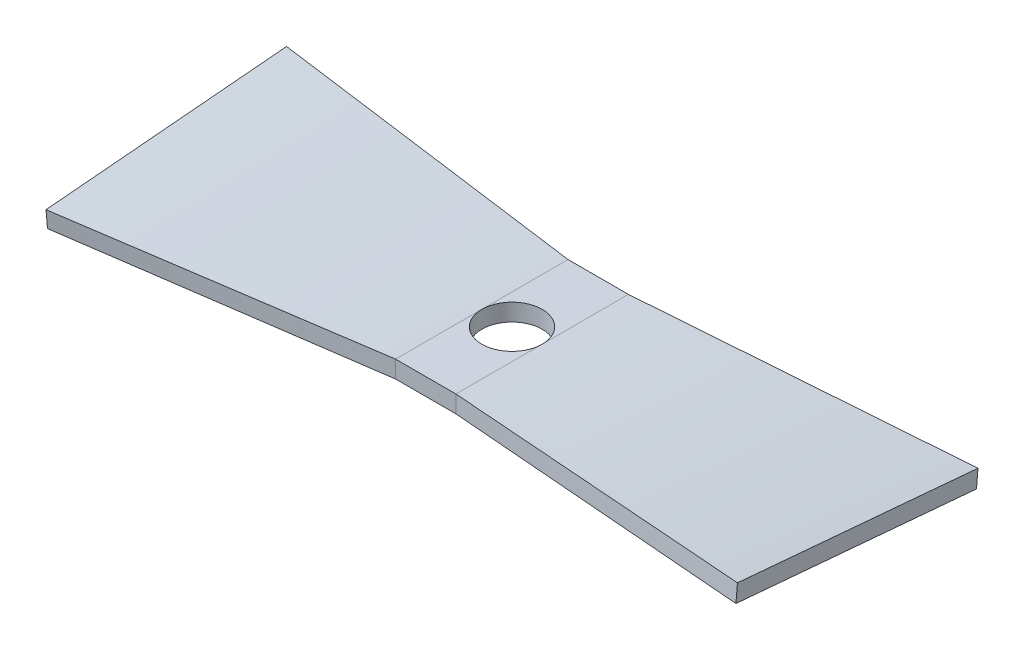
ISO-10303-21;
HEADER;
FILE_DESCRIPTION(('STEP AP214'),'2;1');
FILE_NAME('part.step','',(''),(''),'','','');
FILE_SCHEMA(('AUTOMOTIVE_DESIGN { 1 0 10303 214 1 1 1 1 }'));
ENDSEC;
DATA;
#1=APPLICATION_CONTEXT('core data for automotive mechanical design processes');
#2=APPLICATION_PROTOCOL_DEFINITION('international standard','automotive_design',2000,#1);
#3=PRODUCT_CONTEXT('',#1,'mechanical');
#4=PRODUCT('Part','Part','',(#3));
#5=PRODUCT_RELATED_PRODUCT_CATEGORY('part','',(#4));
#6=PRODUCT_DEFINITION_FORMATION('','',#4);
#7=PRODUCT_DEFINITION_CONTEXT('part definition',#1,'design');
#8=PRODUCT_DEFINITION('design','',#6,#7);
#9=PRODUCT_DEFINITION_SHAPE('','',#8);
#10=(LENGTH_UNIT() NAMED_UNIT(*) SI_UNIT(.MILLI.,.METRE.));
#11=(NAMED_UNIT(*) PLANE_ANGLE_UNIT() SI_UNIT($,.RADIAN.));
#12=(NAMED_UNIT(*) SI_UNIT($,.STERADIAN.) SOLID_ANGLE_UNIT());
#13=UNCERTAINTY_MEASURE_WITH_UNIT(LENGTH_MEASURE(1.E-05),#10,'distance_accuracy_value','');
#14=(GEOMETRIC_REPRESENTATION_CONTEXT(3) GLOBAL_UNCERTAINTY_ASSIGNED_CONTEXT((#13)) GLOBAL_UNIT_ASSIGNED_CONTEXT((#10,
#11,#12)) REPRESENTATION_CONTEXT('',''));
#15=CARTESIAN_POINT('',(0.,0.,0.));
#16=DIRECTION('',(0.,0.,1.));
#17=DIRECTION('',(1.,0.,0.));
#18=AXIS2_PLACEMENT_3D('',#15,#16,#17);
#19=CARTESIAN_POINT('',(-44.1414213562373,0.5,0.));
#20=DIRECTION('',(0.,1.,0.));
#21=DIRECTION('',(0.,0.,1.));
#22=AXIS2_PLACEMENT_3D('',#19,#20,#21);
#23=PLANE('',#22);
#24=CARTESIAN_POINT('',(0.,0.5,0.));
#25=DIRECTION('',(0.,1.,0.));
#26=DIRECTION('',(0.,0.,1.));
#27=AXIS2_PLACEMENT_3D('',#24,#25,#26);
#28=CIRCLE('',#27,1.75);
#29=CARTESIAN_POINT('',(1.75,0.5,0.));
#30=VERTEX_POINT('',#29);
#31=CARTESIAN_POINT('',(-1.75,0.5,0.));
#32=VERTEX_POINT('',#31);
#33=EDGE_CURVE('E68',#30,#32,#28,.T.);
#34=ORIENTED_EDGE('',*,*,#33,.F.);
#35=DIRECTION('',(0.,0.,1.));
#36=VECTOR('',#35,1.);
#37=CARTESIAN_POINT('',(1.75,0.5,0.));
#38=LINE('',#37,#36);
#39=CARTESIAN_POINT('',(1.75000000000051,0.499999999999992,-5.00000000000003));
#40=VERTEX_POINT('',#39);
#41=EDGE_CURVE('E131',#40,#30,#38,.T.);
#42=ORIENTED_EDGE('',*,*,#41,.F.);
#43=DIRECTION('',(1.,0.,0.));
#44=VECTOR('',#43,1.);
#45=CARTESIAN_POINT('',(-44.1414213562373,0.5,-5.));
#46=LINE('',#45,#44);
#47=CARTESIAN_POINT('',(-1.75000000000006,0.500000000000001,-5.));
#48=VERTEX_POINT('',#47);
#49=EDGE_CURVE('E149',#48,#40,#46,.T.);
#50=ORIENTED_EDGE('',*,*,#49,.F.);
#51=DIRECTION('',(0.,0.,1.));
#52=VECTOR('',#51,1.);
#53=CARTESIAN_POINT('',(-1.75,0.5,0.));
#54=LINE('',#53,#52);
#55=EDGE_CURVE('E134',#48,#32,#54,.T.);
#56=ORIENTED_EDGE('',*,*,#55,.T.);
#57=EDGE_LOOP('',(#34,#42,#50,#56));
#58=FACE_BOUND('',#57,.T.);
#59=ADVANCED_FACE('F46',(#58),#23,.T.);
#60=CARTESIAN_POINT('',(-44.1414213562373,-0.5,0.));
#61=DIRECTION('',(0.,1.,0.));
#62=DIRECTION('',(0.,0.,1.));
#63=AXIS2_PLACEMENT_3D('',#60,#61,#62);
#64=PLANE('',#63);
#65=DIRECTION('',(0.,0.,1.));
#66=VECTOR('',#65,1.);
#67=CARTESIAN_POINT('',(1.75,-0.5,0.));
#68=LINE('',#67,#66);
#69=CARTESIAN_POINT('',(1.75000000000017,-0.500000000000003,-5.00000000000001));
#70=VERTEX_POINT('',#69);
#71=CARTESIAN_POINT('',(1.75,-0.5,0.));
#72=VERTEX_POINT('',#71);
#73=EDGE_CURVE('E157',#70,#72,#68,.T.);
#74=ORIENTED_EDGE('',*,*,#73,.T.);
#75=CARTESIAN_POINT('',(0.,-0.5,0.));
#76=DIRECTION('',(0.,1.,0.));
#77=DIRECTION('',(0.,0.,1.));
#78=AXIS2_PLACEMENT_3D('',#75,#76,#77);
#79=CIRCLE('',#78,1.75);
#80=CARTESIAN_POINT('',(-1.75,-0.5,0.));
#81=VERTEX_POINT('',#80);
#82=EDGE_CURVE('E61',#72,#81,#79,.T.);
#83=ORIENTED_EDGE('',*,*,#82,.T.);
#84=DIRECTION('',(0.,0.,1.));
#85=VECTOR('',#84,1.);
#86=CARTESIAN_POINT('',(-1.75,-0.5,0.));
#87=LINE('',#86,#85);
#88=CARTESIAN_POINT('',(-1.75000000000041,-0.499999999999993,-5.00000000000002));
#89=VERTEX_POINT('',#88);
#90=EDGE_CURVE('E50',#89,#81,#87,.T.);
#91=ORIENTED_EDGE('',*,*,#90,.F.);
#92=DIRECTION('',(1.,0.,0.));
#93=VECTOR('',#92,1.);
#94=CARTESIAN_POINT('',(-44.1414213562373,-0.5,-5.));
#95=LINE('',#94,#93);
#96=EDGE_CURVE('E160',#89,#70,#95,.T.);
#97=ORIENTED_EDGE('',*,*,#96,.T.);
#98=EDGE_LOOP('',(#74,#83,#91,#97));
#99=FACE_BOUND('',#98,.T.);
#100=ADVANCED_FACE('F453',(#99),#64,.F.);
#101=CARTESIAN_POINT('',(-44.1414213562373,0.5,4.99999999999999));
#102=DIRECTION('',(0.,0.,-1.));
#103=DIRECTION('',(-1.,0.,0.));
#104=AXIS2_PLACEMENT_3D('',#101,#102,#103);
#105=PLANE('',#104);
#106=DIRECTION('',(1.,0.,0.));
#107=VECTOR('',#106,1.);
#108=CARTESIAN_POINT('',(-44.1414213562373,-0.5,4.99999999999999));
#109=LINE('',#108,#107);
#110=CARTESIAN_POINT('',(-1.75000000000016,-0.500000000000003,5.));
#111=VERTEX_POINT('',#110);
#112=CARTESIAN_POINT('',(1.74999999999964,-0.500000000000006,4.99999999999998));
#113=VERTEX_POINT('',#112);
#114=EDGE_CURVE('E166',#111,#113,#109,.T.);
#115=ORIENTED_EDGE('',*,*,#114,.T.);
#116=DIRECTION('',(0.,1.,0.));
#117=VECTOR('',#116,1.);
#118=CARTESIAN_POINT('',(1.75,0.5,4.99999999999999));
#119=LINE('',#118,#117);
#120=CARTESIAN_POINT('',(1.75000000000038,0.500000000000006,5.00000000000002));
#121=VERTEX_POINT('',#120);
#122=EDGE_CURVE('E55',#121,#113,#119,.F.);
#123=ORIENTED_EDGE('',*,*,#122,.F.);
#124=DIRECTION('',(1.,0.,0.));
#125=VECTOR('',#124,1.);
#126=CARTESIAN_POINT('',(-44.1414213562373,0.5,4.99999999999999));
#127=LINE('',#126,#125);
#128=CARTESIAN_POINT('',(-1.75000000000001,0.5,5.));
#129=VERTEX_POINT('',#128);
#130=EDGE_CURVE('E140',#129,#121,#127,.T.);
#131=ORIENTED_EDGE('',*,*,#130,.F.);
#132=DIRECTION('',(0.,1.,0.));
#133=VECTOR('',#132,1.);
#134=CARTESIAN_POINT('',(-1.75,0.5,4.99999999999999));
#135=LINE('',#134,#133);
#136=EDGE_CURVE('E12',#129,#111,#135,.F.);
#137=ORIENTED_EDGE('',*,*,#136,.T.);
#138=EDGE_LOOP('',(#115,#123,#131,#137));
#139=FACE_BOUND('',#138,.T.);
#140=ADVANCED_FACE('F48',(#139),#105,.F.);
#141=CARTESIAN_POINT('',(-44.1414213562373,0.5,-5.));
#142=DIRECTION('',(0.,0.,-1.));
#143=DIRECTION('',(-1.,0.,0.));
#144=AXIS2_PLACEMENT_3D('',#141,#142,#143);
#145=PLANE('',#144);
#146=ORIENTED_EDGE('',*,*,#96,.F.);
#147=DIRECTION('',(0.,1.,0.));
#148=VECTOR('',#147,1.);
#149=CARTESIAN_POINT('',(-1.75,0.5,-5.));
#150=LINE('',#149,#148);
#151=EDGE_CURVE('E150',#48,#89,#150,.F.);
#152=ORIENTED_EDGE('',*,*,#151,.F.);
#153=ORIENTED_EDGE('',*,*,#49,.T.);
#154=DIRECTION('',(0.,1.,0.));
#155=VECTOR('',#154,1.);
#156=CARTESIAN_POINT('',(1.75,0.5,-5.));
#157=LINE('',#156,#155);
#158=EDGE_CURVE('E155',#40,#70,#157,.F.);
#159=ORIENTED_EDGE('',*,*,#158,.T.);
#160=EDGE_LOOP('',(#146,#152,#153,#159));
#161=FACE_BOUND('',#160,.T.);
#162=ADVANCED_FACE('F450',(#161),#145,.T.);
#163=EDGE_CURVE('E121',#32,#30,#28,.T.);
#164=ORIENTED_EDGE('',*,*,#163,.F.);
#165=EDGE_CURVE('E163',#32,#129,#54,.T.);
#166=ORIENTED_EDGE('',*,*,#165,.T.);
#167=ORIENTED_EDGE('',*,*,#130,.T.);
#168=EDGE_CURVE('E137',#30,#121,#38,.T.);
#169=ORIENTED_EDGE('',*,*,#168,.F.);
#170=EDGE_LOOP('',(#164,#166,#167,#169));
#171=FACE_BOUND('',#170,.T.);
#172=ADVANCED_FACE('F138',(#171),#23,.T.);
#173=EDGE_CURVE('E404',#81,#111,#87,.T.);
#174=ORIENTED_EDGE('',*,*,#173,.F.);
#175=EDGE_CURVE('E135',#81,#72,#79,.T.);
#176=ORIENTED_EDGE('',*,*,#175,.T.);
#177=EDGE_CURVE('E161',#72,#113,#68,.T.);
#178=ORIENTED_EDGE('',*,*,#177,.T.);
#179=ORIENTED_EDGE('',*,*,#114,.F.);
#180=EDGE_LOOP('',(#174,#176,#178,#179));
#181=FACE_BOUND('',#180,.T.);
#182=ADVANCED_FACE('F367',(#181),#64,.F.);
#183=CARTESIAN_POINT('',(20.,-1.10818754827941,-6.92978501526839));
#184=DIRECTION('',(-1.,0.,0.));
#185=DIRECTION('',(0.,-1.,0.));
#186=AXIS2_PLACEMENT_3D('',#183,#184,#185);
#187=PLANE('',#186);
#188=DIRECTION('',(0.,-0.996194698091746,0.0871557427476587));
#189=VECTOR('',#188,1.);
#190=CARTESIAN_POINT('',(20.,-0.111992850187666,-7.01694075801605));
#191=LINE('',#190,#189);
#192=CARTESIAN_POINT('',(20.,-0.111992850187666,-7.01694075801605));
#193=VERTEX_POINT('',#192);
#194=CARTESIAN_POINT('',(20.,-1.10818754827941,-6.92978501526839));
#195=VERTEX_POINT('',#194);
#196=EDGE_CURVE('E398',#193,#195,#191,.T.);
#197=ORIENTED_EDGE('',*,*,#196,.F.);
#198=DIRECTION('',(0.,-0.0871557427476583,-0.996194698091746));
#199=VECTOR('',#198,1.);
#200=CARTESIAN_POINT('',(20.,-0.111992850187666,-7.01694075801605));
#201=LINE('',#200,#199);
#202=CARTESIAN_POINT('',(20.,1.10818754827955,6.92978501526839));
#203=VERTEX_POINT('',#202);
#204=EDGE_CURVE('E335',#203,#193,#201,.T.);
#205=ORIENTED_EDGE('',*,*,#204,.F.);
#206=DIRECTION('',(0.,0.996194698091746,-0.0871557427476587));
#207=VECTOR('',#206,1.);
#208=CARTESIAN_POINT('',(20.,1.10818754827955,6.92978501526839));
#209=LINE('',#208,#207);
#210=CARTESIAN_POINT('',(20.,0.111992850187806,7.01694075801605));
#211=VERTEX_POINT('',#210);
#212=EDGE_CURVE('E397',#211,#203,#209,.T.);
#213=ORIENTED_EDGE('',*,*,#212,.F.);
#214=DIRECTION('',(0.,0.0871557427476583,0.996194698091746));
#215=VECTOR('',#214,1.);
#216=CARTESIAN_POINT('',(20.,-1.10818754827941,-6.92978501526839));
#217=LINE('',#216,#215);
#218=EDGE_CURVE('E389',#195,#211,#217,.T.);
#219=ORIENTED_EDGE('',*,*,#218,.F.);
#220=EDGE_LOOP('',(#197,#205,#213,#219));
#221=FACE_BOUND('',#220,.T.);
#222=ADVANCED_FACE('F355',(#221),#187,.F.);
#223=CARTESIAN_POINT('',(20.,1.10818754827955,6.9297850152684));
#224=CARTESIAN_POINT('',(1.75,0.5,4.99999999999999));
#225=CARTESIAN_POINT('',(20.,0.904824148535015,4.60533071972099));
#226=CARTESIAN_POINT('',(1.75,0.5,3.33333333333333));
#227=CARTESIAN_POINT('',(20.,0.701460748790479,2.28087642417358));
#228=CARTESIAN_POINT('',(1.75,0.5,1.66666666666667));
#229=CARTESIAN_POINT('',(20.,0.294733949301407,-2.36803216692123));
#230=CARTESIAN_POINT('',(1.75,0.5,-1.66666666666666));
#231=CARTESIAN_POINT('',(20.,0.0913705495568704,-4.69248646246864));
#232=CARTESIAN_POINT('',(1.75,0.5,-3.33333333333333));
#233=CARTESIAN_POINT('',(20.,-0.111992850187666,-7.01694075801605));
#234=CARTESIAN_POINT('',(1.75,0.5,-5.));
#235=B_SPLINE_SURFACE_WITH_KNOTS('',3,1,((#223,#224),(#225,#226),(#227,#228),(#229,#230),(#231,
#232),(#233,#234)),.UNSPECIFIED.,.F.,.F.,.F.,(4,2,4),(2,2),(0.,0.5,1.),(0.,1.),.UNSPECIFIED.);
#236=DIRECTION('',(-0.993396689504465,0.0333124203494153,0.109787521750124));
#237=VECTOR('',#236,1.);
#238=CARTESIAN_POINT('',(10.875,0.194003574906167,-6.00847037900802));
#239=LINE('',#238,#237);
#240=EDGE_CURVE('E148',#193,#40,#239,.T.);
#241=DIRECTION('',(0.993910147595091,0.0331223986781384,0.105097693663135));
#242=VECTOR('',#241,1.);
#243=CARTESIAN_POINT('',(10.875,0.804093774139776,5.9648925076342));
#244=LINE('',#243,#242);
#245=EDGE_CURVE('E341',#121,#203,#244,.T.);
#246=ORIENTED_EDGE('',*,*,#204,.T.);
#247=ORIENTED_EDGE('',*,*,#240,.T.);
#248=ORIENTED_EDGE('',*,*,#41,.T.);
#249=ORIENTED_EDGE('',*,*,#168,.T.);
#250=ORIENTED_EDGE('',*,*,#245,.T.);
#251=EDGE_LOOP('',(#246,#247,#248,#249,#250));
#252=FACE_BOUND('',#251,.T.);
#253=ADVANCED_FACE('F147',(#252),#235,.T.);
#254=CARTESIAN_POINT('',(20.,-0.111992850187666,-7.01694075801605));
#255=CARTESIAN_POINT('',(1.75,0.5,-5.));
#256=CARTESIAN_POINT('',(20.,-0.278025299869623,-7.00241480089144));
#257=CARTESIAN_POINT('',(1.75,0.333333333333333,-5.));
#258=CARTESIAN_POINT('',(20.,-0.444057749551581,-6.98788884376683));
#259=CARTESIAN_POINT('',(1.75,0.166666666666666,-5.));
#260=CARTESIAN_POINT('',(20.,-0.776122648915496,-6.95883692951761));
#261=CARTESIAN_POINT('',(1.75,-0.166666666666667,-5.));
#262=CARTESIAN_POINT('',(20.,-0.942155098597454,-6.944310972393));
#263=CARTESIAN_POINT('',(1.75,-0.333333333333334,-5.));
#264=CARTESIAN_POINT('',(20.,-1.10818754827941,-6.92978501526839));
#265=CARTESIAN_POINT('',(1.75,-0.5,-5.));
#266=B_SPLINE_SURFACE_WITH_KNOTS('',3,1,((#254,#255),(#256,#257),(#258,#259),(#260,#261),(#262,
#263),(#264,#265)),.UNSPECIFIED.,.F.,.F.,.F.,(4,2,4),(2,2),(0.,0.5,1.),(0.,1.),.UNSPECIFIED.);
#267=DIRECTION('',(-0.993910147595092,0.0331223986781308,0.105097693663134));
#268=VECTOR('',#267,1.);
#269=CARTESIAN_POINT('',(10.875,-0.804093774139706,-5.96489250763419));
#270=LINE('',#269,#268);
#271=EDGE_CURVE('E419',#195,#70,#270,.T.);
#272=ORIENTED_EDGE('',*,*,#196,.T.);
#273=ORIENTED_EDGE('',*,*,#271,.T.);
#274=ORIENTED_EDGE('',*,*,#158,.F.);
#275=ORIENTED_EDGE('',*,*,#240,.F.);
#276=EDGE_LOOP('',(#272,#273,#274,#275));
#277=FACE_BOUND('',#276,.T.);
#278=ADVANCED_FACE('F354',(#277),#266,.T.);
#279=CARTESIAN_POINT('',(20.,0.111992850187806,7.01694075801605));
#280=CARTESIAN_POINT('',(1.75,-0.5,4.99999999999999));
#281=CARTESIAN_POINT('',(20.,0.278025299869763,7.00241480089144));
#282=CARTESIAN_POINT('',(1.75,-0.333333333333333,4.99999999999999));
#283=CARTESIAN_POINT('',(20.,0.444057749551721,6.98788884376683));
#284=CARTESIAN_POINT('',(1.75,-0.166666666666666,4.99999999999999));
#285=CARTESIAN_POINT('',(20.,0.776122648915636,6.95883692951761));
#286=CARTESIAN_POINT('',(1.75,0.166666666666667,4.99999999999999));
#287=CARTESIAN_POINT('',(20.,0.942155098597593,6.944310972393));
#288=CARTESIAN_POINT('',(1.75,0.333333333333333,4.99999999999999));
#289=CARTESIAN_POINT('',(20.,1.10818754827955,6.92978501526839));
#290=CARTESIAN_POINT('',(1.75,0.5,4.99999999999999));
#291=B_SPLINE_SURFACE_WITH_KNOTS('',3,1,((#279,#280),(#281,#282),(#283,#284),(#285,#286),(#287,
#288),(#289,#290)),.UNSPECIFIED.,.F.,.F.,.F.,(4,2,4),(2,2),(0.,0.5,1.),(0.,1.),.UNSPECIFIED.);
#292=DIRECTION('',(-0.993396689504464,-0.0333124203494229,-0.109787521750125));
#293=VECTOR('',#292,1.);
#294=CARTESIAN_POINT('',(10.875,-0.194003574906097,6.00847037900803));
#295=LINE('',#294,#293);
#296=EDGE_CURVE('E283',#211,#113,#295,.T.);
#297=ORIENTED_EDGE('',*,*,#212,.T.);
#298=ORIENTED_EDGE('',*,*,#245,.F.);
#299=ORIENTED_EDGE('',*,*,#122,.T.);
#300=ORIENTED_EDGE('',*,*,#296,.F.);
#301=EDGE_LOOP('',(#297,#298,#299,#300));
#302=FACE_BOUND('',#301,.T.);
#303=ADVANCED_FACE('F416',(#302),#291,.T.);
#304=CARTESIAN_POINT('',(20.,-1.10818754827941,-6.92978501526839));
#305=CARTESIAN_POINT('',(1.75,-0.5,-5.));
#306=CARTESIAN_POINT('',(20.,-0.904824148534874,-4.60533071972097));
#307=CARTESIAN_POINT('',(1.75,-0.5,-3.33333333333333));
#308=CARTESIAN_POINT('',(20.,-0.701460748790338,-2.28087642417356));
#309=CARTESIAN_POINT('',(1.75,-0.5,-1.66666666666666));
#310=CARTESIAN_POINT('',(20.,-0.294733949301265,2.36803216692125));
#311=CARTESIAN_POINT('',(1.75,-0.5,1.66666666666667));
#312=CARTESIAN_POINT('',(20.,-0.0913705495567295,4.69248646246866));
#313=CARTESIAN_POINT('',(1.75,-0.5,3.33333333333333));
#314=CARTESIAN_POINT('',(20.,0.111992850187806,7.01694075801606));
#315=CARTESIAN_POINT('',(1.75,-0.5,4.99999999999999));
#316=B_SPLINE_SURFACE_WITH_KNOTS('',3,1,((#304,#305),(#306,#307),(#308,#309),(#310,#311),(#312,
#313),(#314,#315)),.UNSPECIFIED.,.F.,.F.,.F.,(4,2,4),(2,2),(0.,0.5,1.),(0.,1.),.UNSPECIFIED.);
#317=ORIENTED_EDGE('',*,*,#218,.T.);
#318=ORIENTED_EDGE('',*,*,#296,.T.);
#319=ORIENTED_EDGE('',*,*,#177,.F.);
#320=ORIENTED_EDGE('',*,*,#73,.F.);
#321=ORIENTED_EDGE('',*,*,#271,.F.);
#322=EDGE_LOOP('',(#317,#318,#319,#320,#321));
#323=FACE_BOUND('',#322,.T.);
#324=ADVANCED_FACE('F302',(#323),#316,.T.);
#325=CARTESIAN_POINT('',(-20.,-0.111992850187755,7.01694075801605));
#326=DIRECTION('',(-1.,0.,0.));
#327=DIRECTION('',(0.,-1.,0.));
#328=AXIS2_PLACEMENT_3D('',#325,#326,#327);
#329=PLANE('',#328);
#330=DIRECTION('',(0.,0.996194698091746,0.0871557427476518));
#331=VECTOR('',#330,1.);
#332=CARTESIAN_POINT('',(-20.,-1.1081875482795,6.9297850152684));
#333=LINE('',#332,#331);
#334=CARTESIAN_POINT('',(-20.,-1.1081875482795,6.9297850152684));
#335=VERTEX_POINT('',#334);
#336=CARTESIAN_POINT('',(-20.,-0.111992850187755,7.01694075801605));
#337=VERTEX_POINT('',#336);
#338=EDGE_CURVE('E204',#335,#337,#333,.T.);
#339=ORIENTED_EDGE('',*,*,#338,.T.);
#340=DIRECTION('',(0.,0.0871557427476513,-0.996194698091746));
#341=VECTOR('',#340,1.);
#342=CARTESIAN_POINT('',(-20.,-0.111992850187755,7.01694075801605));
#343=LINE('',#342,#341);
#344=CARTESIAN_POINT('',(-20.,1.10818754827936,-6.9297850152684));
#345=VERTEX_POINT('',#344);
#346=EDGE_CURVE('E189',#337,#345,#343,.T.);
#347=ORIENTED_EDGE('',*,*,#346,.T.);
#348=DIRECTION('',(0.,-0.996194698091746,-0.0871557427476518));
#349=VECTOR('',#348,1.);
#350=CARTESIAN_POINT('',(-20.,1.10818754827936,-6.9297850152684));
#351=LINE('',#350,#349);
#352=CARTESIAN_POINT('',(-20.,0.111992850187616,-7.01694075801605));
#353=VERTEX_POINT('',#352);
#354=EDGE_CURVE('E260',#345,#353,#351,.T.);
#355=ORIENTED_EDGE('',*,*,#354,.T.);
#356=DIRECTION('',(0.,-0.0871557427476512,0.996194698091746));
#357=VECTOR('',#356,1.);
#358=CARTESIAN_POINT('',(-20.,-1.1081875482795,6.9297850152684));
#359=LINE('',#358,#357);
#360=EDGE_CURVE('E279',#353,#335,#359,.T.);
#361=ORIENTED_EDGE('',*,*,#360,.T.);
#362=EDGE_LOOP('',(#339,#347,#355,#361));
#363=FACE_BOUND('',#362,.T.);
#364=ADVANCED_FACE('F286',(#363),#329,.T.);
#365=CARTESIAN_POINT('',(-20.,-1.1081875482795,6.9297850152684));
#366=CARTESIAN_POINT('',(-1.75,-0.5,4.99999999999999));
#367=CARTESIAN_POINT('',(-20.,-0.904824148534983,4.605330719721));
#368=CARTESIAN_POINT('',(-1.75,-0.5,3.33333333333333));
#369=CARTESIAN_POINT('',(-20.,-0.701460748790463,2.28087642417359));
#370=CARTESIAN_POINT('',(-1.75,-0.5,1.66666666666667));
#371=CARTESIAN_POINT('',(-20.,-0.294733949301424,-2.36803216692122));
#372=CARTESIAN_POINT('',(-1.75,-0.5,-1.66666666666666));
#373=CARTESIAN_POINT('',(-20.,-0.0913705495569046,-4.69248646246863));
#374=CARTESIAN_POINT('',(-1.75,-0.5,-3.33333333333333));
#375=CARTESIAN_POINT('',(-20.,0.111992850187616,-7.01694075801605));
#376=CARTESIAN_POINT('',(-1.75,-0.5,-5.));
#377=B_SPLINE_SURFACE_WITH_KNOTS('',3,1,((#365,#366),(#367,#368),(#369,#370),(#371,#372),(#373,
#374),(#375,#376)),.UNSPECIFIED.,.F.,.F.,.F.,(4,2,4),(2,2),(0.,0.5,1.),(0.,1.),.UNSPECIFIED.);
#378=DIRECTION('',(0.993396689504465,-0.0333124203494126,0.109787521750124));
#379=VECTOR('',#378,1.);
#380=CARTESIAN_POINT('',(-10.875,-0.194003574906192,-6.00847037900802));
#381=LINE('',#380,#379);
#382=EDGE_CURVE('E263',#353,#89,#381,.T.);
#383=DIRECTION('',(-0.993910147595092,-0.0331223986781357,0.105097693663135));
#384=VECTOR('',#383,1.);
#385=CARTESIAN_POINT('',(-10.875,-0.804093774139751,5.96489250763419));
#386=LINE('',#385,#384);
#387=EDGE_CURVE('E185',#111,#335,#386,.T.);
#388=ORIENTED_EDGE('',*,*,#360,.F.);
#389=ORIENTED_EDGE('',*,*,#382,.T.);
#390=ORIENTED_EDGE('',*,*,#90,.T.);
#391=ORIENTED_EDGE('',*,*,#173,.T.);
#392=ORIENTED_EDGE('',*,*,#387,.T.);
#393=EDGE_LOOP('',(#388,#389,#390,#391,#392));
#394=FACE_BOUND('',#393,.T.);
#395=ADVANCED_FACE('F236',(#394),#377,.T.);
#396=CARTESIAN_POINT('',(-20.,0.111992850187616,-7.01694075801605));
#397=CARTESIAN_POINT('',(-1.75,-0.5,-5.));
#398=CARTESIAN_POINT('',(-20.,0.278025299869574,-7.00241480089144));
#399=CARTESIAN_POINT('',(-1.75,-0.333333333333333,-5.));
#400=CARTESIAN_POINT('',(-20.,0.444057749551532,-6.98788884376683));
#401=CARTESIAN_POINT('',(-1.75,-0.166666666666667,-5.));
#402=CARTESIAN_POINT('',(-20.,0.776122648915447,-6.95883692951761));
#403=CARTESIAN_POINT('',(-1.75,0.166666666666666,-5.));
#404=CARTESIAN_POINT('',(-20.,0.942155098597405,-6.944310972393));
#405=CARTESIAN_POINT('',(-1.75,0.333333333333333,-5.));
#406=CARTESIAN_POINT('',(-20.,1.10818754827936,-6.9297850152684));
#407=CARTESIAN_POINT('',(-1.75,0.5,-5.));
#408=B_SPLINE_SURFACE_WITH_KNOTS('',3,1,((#396,#397),(#398,#399),(#400,#401),(#402,#403),(#404,
#405),(#406,#407)),.UNSPECIFIED.,.F.,.F.,.F.,(4,2,4),(2,2),(0.,0.5,1.),(0.,1.),.UNSPECIFIED.);
#409=DIRECTION('',(0.993910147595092,-0.0331223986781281,0.105097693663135));
#410=VECTOR('',#409,1.);
#411=CARTESIAN_POINT('',(-10.875,0.804093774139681,-5.9648925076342));
#412=LINE('',#411,#410);
#413=EDGE_CURVE('E191',#345,#48,#412,.T.);
#414=ORIENTED_EDGE('',*,*,#354,.F.);
#415=ORIENTED_EDGE('',*,*,#413,.T.);
#416=ORIENTED_EDGE('',*,*,#151,.T.);
#417=ORIENTED_EDGE('',*,*,#382,.F.);
#418=EDGE_LOOP('',(#414,#415,#416,#417));
#419=FACE_BOUND('',#418,.T.);
#420=ADVANCED_FACE('F221',(#419),#408,.T.);
#421=CARTESIAN_POINT('',(-20.,-0.111992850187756,7.01694075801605));
#422=CARTESIAN_POINT('',(-1.75,0.5,5.));
#423=CARTESIAN_POINT('',(-20.,-0.278025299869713,7.00241480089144));
#424=CARTESIAN_POINT('',(-1.75,0.333333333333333,5.));
#425=CARTESIAN_POINT('',(-20.,-0.444057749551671,6.98788884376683));
#426=CARTESIAN_POINT('',(-1.75,0.166666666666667,5.));
#427=CARTESIAN_POINT('',(-20.,-0.776122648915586,6.95883692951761));
#428=CARTESIAN_POINT('',(-1.75,-0.166666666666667,5.));
#429=CARTESIAN_POINT('',(-20.,-0.942155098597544,6.944310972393));
#430=CARTESIAN_POINT('',(-1.75,-0.333333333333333,5.));
#431=CARTESIAN_POINT('',(-20.,-1.1081875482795,6.9297850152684));
#432=CARTESIAN_POINT('',(-1.75,-0.5,5.));
#433=B_SPLINE_SURFACE_WITH_KNOTS('',3,1,((#421,#422),(#423,#424),(#425,#426),(#427,#428),(#429,
#430),(#431,#432)),.UNSPECIFIED.,.F.,.F.,.F.,(4,2,4),(2,2),(0.,0.5,1.),(0.,1.),.UNSPECIFIED.);
#434=DIRECTION('',(0.993396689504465,0.0333124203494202,-0.109787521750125));
#435=VECTOR('',#434,1.);
#436=CARTESIAN_POINT('',(-10.875,0.194003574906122,6.00847037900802));
#437=LINE('',#436,#435);
#438=EDGE_CURVE('E182',#337,#129,#437,.T.);
#439=ORIENTED_EDGE('',*,*,#338,.F.);
#440=ORIENTED_EDGE('',*,*,#387,.F.);
#441=ORIENTED_EDGE('',*,*,#136,.F.);
#442=ORIENTED_EDGE('',*,*,#438,.F.);
#443=EDGE_LOOP('',(#439,#440,#441,#442));
#444=FACE_BOUND('',#443,.T.);
#445=ADVANCED_FACE('F181',(#444),#433,.T.);
#446=CARTESIAN_POINT('',(-20.,1.10818754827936,-6.9297850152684));
#447=CARTESIAN_POINT('',(-1.75,0.5,-5.));
#448=CARTESIAN_POINT('',(-20.,0.904824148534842,-4.60533071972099));
#449=CARTESIAN_POINT('',(-1.75,0.5,-3.33333333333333));
#450=CARTESIAN_POINT('',(-20.,0.701460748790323,-2.28087642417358));
#451=CARTESIAN_POINT('',(-1.75,0.5,-1.66666666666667));
#452=CARTESIAN_POINT('',(-20.,0.294733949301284,2.36803216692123));
#453=CARTESIAN_POINT('',(-1.75,0.5,1.66666666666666));
#454=CARTESIAN_POINT('',(-20.,0.0913705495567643,4.69248646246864));
#455=CARTESIAN_POINT('',(-1.75,0.5,3.33333333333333));
#456=CARTESIAN_POINT('',(-20.,-0.111992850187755,7.01694075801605));
#457=CARTESIAN_POINT('',(-1.75,0.5,4.99999999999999));
#458=B_SPLINE_SURFACE_WITH_KNOTS('',3,1,((#446,#447),(#448,#449),(#450,#451),(#452,#453),(#454,
#455),(#456,#457)),.UNSPECIFIED.,.F.,.F.,.F.,(4,2,4),(2,2),(0.,0.5,1.),(0.,1.),.UNSPECIFIED.);
#459=ORIENTED_EDGE('',*,*,#346,.F.);
#460=ORIENTED_EDGE('',*,*,#438,.T.);
#461=ORIENTED_EDGE('',*,*,#165,.F.);
#462=ORIENTED_EDGE('',*,*,#55,.F.);
#463=ORIENTED_EDGE('',*,*,#413,.F.);
#464=EDGE_LOOP('',(#459,#460,#461,#462,#463));
#465=FACE_BOUND('',#464,.T.);
#466=ADVANCED_FACE('F186',(#465),#458,.T.);
#467=CARTESIAN_POINT('',(0.,-0.5,0.));
#468=DIRECTION('',(0.,1.,0.));
#469=DIRECTION('',(0.,0.,1.));
#470=AXIS2_PLACEMENT_3D('',#467,#468,#469);
#471=CYLINDRICAL_SURFACE('',#470,1.75);
#472=ORIENTED_EDGE('',*,*,#82,.F.);
#473=ORIENTED_EDGE('',*,*,#175,.F.);
#474=EDGE_LOOP('',(#472,#473));
#475=FACE_BOUND('',#474,.T.);
#476=ORIENTED_EDGE('',*,*,#33,.T.);
#477=ORIENTED_EDGE('',*,*,#163,.T.);
#478=EDGE_LOOP('',(#476,#477));
#479=FACE_BOUND('',#478,.T.);
#480=ADVANCED_FACE('F122',(#475,#479),#471,.F.);
#481=CLOSED_SHELL('',(#59,#100,#140,#162,#172,#182,#222,#253,#278,#303,#324,#364,#395,#420,#445,
#466,#480));
#482=MANIFOLD_SOLID_BREP('B2',#481);
#483=ADVANCED_BREP_SHAPE_REPRESENTATION('',(#18,#482),#14);
#484=SHAPE_DEFINITION_REPRESENTATION(#9,#483);
ENDSEC;
END-ISO-10303-21;
